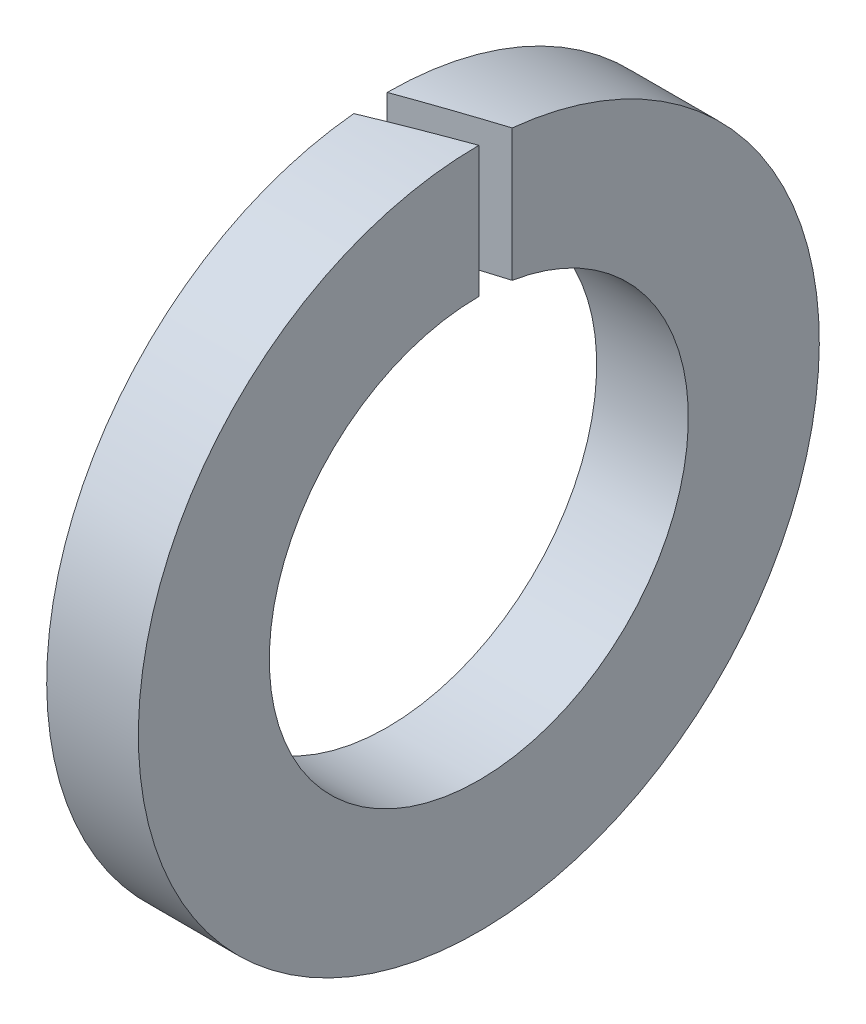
from build123d import *

# Parameters (mm, degrees)
ESQUISSE1_W             = 1.4
ESQUISSE1_H             = 2
ENL_V_MAT_EXTRU_1_DEPTH = 8.485986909


with BuildPart() as part:
    # Esquisse1 → Base-R_volution (revolve)
    with BuildSketch(Plane(origin=(0, 0, 0), x_dir=(1, 0, 0), z_dir=(0, 1, 0))):
        with Locations((0.7, 4.2)):
            Rectangle(ESQUISSE1_W, ESQUISSE1_H)
    revolve(axis=Axis((0, 0, 0), (1, 0, 0)))

    # Esquisse2 → Enl_v. mat.-Extru.1 (cut, through all)
    with BuildSketch(Plane(origin=(0, 0, 0), x_dir=(1, 0, 0), z_dir=(0, 1, 0))):
        Polygon((0, 0), (1.4, 0.509558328), (1.4, 0), (0, -0.509558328), align=None)
    extrude(amount=ENL_V_MAT_EXTRU_1_DEPTH, mode=Mode.SUBTRACT)


solid = part.part
